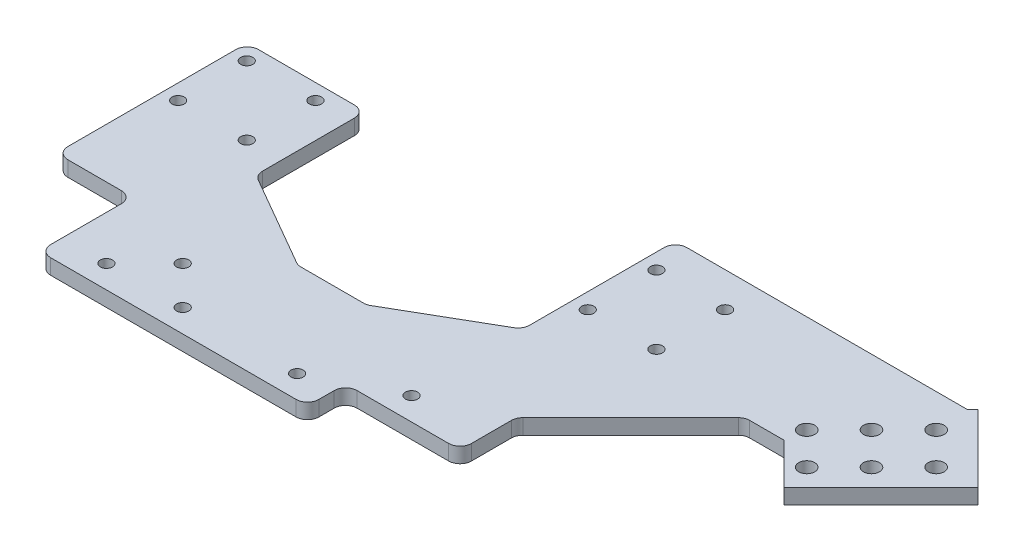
from build123d import *
from OCP.BRepFilletAPI import BRepFilletAPI_MakeChamfer

# Parameters (mm, degrees)
SKETCH_1_R          = 1.6
EXTRUDE_1_DEPTH     = 4
CUT_EXTRUDE_1_REACH = 136.759
SKETCH_2_W          = 30
SKETCH_2_H          = 10
CHAMFER_1_SIZE      = 15
CHAMFER_1_SIZE2     = 25.980762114
FILLET_1_R          = 3
EXTRUDE_2_DEPTH     = 4
SKETCH_4_R          = 2.1
CUT_EXTRUDE_2_DEPTH = 149.017584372


with BuildPart() as part:
    # Sketch 1 → Extrude 1 (new body)
    with BuildSketch(Plane(origin=(0, 0, 0), x_dir=(1, 0, 0), z_dir=(0, 1, 0))):
        Polygon((-56.1, -85.7), (44.22, -85.7), (44.22, -61), (74.22, -31), (103.92, -31), (103.92, 0), (25, 0), (25, -55), (-45, -55), (-45, -11.2), (-76.1, -11.2), (-76.1, -61.2), (-56.1, -61.2), align=None)
        with Locations(Location((5.5, -79.7, 0), (0, 0, 270))):
            Circle(SKETCH_1_R, mode=Mode.SUBTRACT)
        with Locations(Location((25.5, -79.7, 0), (0, 0, 270))):
            Circle(SKETCH_1_R, mode=Mode.SUBTRACT)
        with Locations(Location((25.5, -69.7, 0), (0, 0, 270))):
            Circle(SKETCH_1_R, mode=Mode.SUBTRACT)
        with Locations(Location((-72.1, -15.3, 0), (0, 0, 270))):
            Circle(SKETCH_1_R, mode=Mode.SUBTRACT)
        with Locations(Location((-54.1, -15.3, 0), (0, 0, 270))):
            Circle(SKETCH_1_R, mode=Mode.SUBTRACT)
        with Locations(Location((-54.1, -33.3, 0), (0, 0, 270))):
            Circle(SKETCH_1_R, mode=Mode.SUBTRACT)
        with Locations(Location((-72.1, -33.3, 0), (0, 0, 270))):
            Circle(SKETCH_1_R, mode=Mode.SUBTRACT)
        with Locations(Location((47.1, -27.1, 0), (0, 0, 270))):
            Circle(SKETCH_1_R, mode=Mode.SUBTRACT)
        with Locations(Location((47.1, -9.1, 0), (0, 0, 270))):
            Circle(SKETCH_1_R, mode=Mode.SUBTRACT)
        with Locations(Location((29.1, -9.1, 0), (0, 0, 270))):
            Circle(SKETCH_1_R, mode=Mode.SUBTRACT)
        with Locations(Location((29.1, -27.1, 0), (0, 0, 270))):
            Circle(SKETCH_1_R, mode=Mode.SUBTRACT)
        with Locations(Location((-24.5, -79.7, 0), (0, 0, 270))):
            Circle(SKETCH_1_R, mode=Mode.SUBTRACT)
        with Locations(Location((-44.5, -79.7, 0), (0, 0, 270))):
            Circle(SKETCH_1_R, mode=Mode.SUBTRACT)
        with Locations(Location((-34.5, -69.7, 0), (0, 0, 270))):
            Circle(SKETCH_1_R, mode=Mode.SUBTRACT)
    extrude(amount=EXTRUDE_1_DEPTH)

    # Sketch 2 → Cut-Extrude 1 (cut, up to next)
    with BuildSketch(Plane(origin=(0, 4, 0), x_dir=(1, 0, 0), z_dir=(0, 1, 0)), mode=Mode.PRIVATE) as cut_extrude_1_sk1:
        with Locations((29.22, -80.7)):
            Rectangle(SKETCH_2_W, SKETCH_2_H)
    cut_extrude_1_tool1 = extrude(cut_extrude_1_sk1.sketch, amount=-CUT_EXTRUDE_1_REACH, mode=Mode.PRIVATE) & part.part
    add(cut_extrude_1_tool1.solids().sort_by_distance((29.22, 4, 80.7))[0], mode=Mode.SUBTRACT)

    # Chamfer 1: one chamfer whose edges measure the first distance from different faces: ONE call of the kernel's chamfer builder (chamfer() names one face for all edges)
    chamfer_1_edges_1 = [part.edges().sort_by_distance(p)[0] for p in [
        (-45, 2, 55),
    ]]
    chamfer_1_side_1 = [part.faces().sort_by_distance(p)[0] for p in [
        (-45, 2, 33.1),
    ]]
    chamfer_1_edges_2 = [part.edges().sort_by_distance(p)[0] for p in [
        (25, 2, 55),
    ]]
    chamfer_1_side_2 = [part.faces().sort_by_distance(p)[0] for p in [
        (25, 2, 27.5),
    ]]
    chamfer_1 = BRepFilletAPI_MakeChamfer(part.part.solid().wrapped)
    for e in chamfer_1_edges_1:
        chamfer_1.Add(CHAMFER_1_SIZE, CHAMFER_1_SIZE2, e.wrapped, chamfer_1_side_1[0].wrapped)  # the first distance lies on this face
    for e in chamfer_1_edges_2:
        chamfer_1.Add(CHAMFER_1_SIZE, CHAMFER_1_SIZE2, e.wrapped, chamfer_1_side_2[0].wrapped)  # the first distance lies on this face
    add(Compound.cast(chamfer_1.Shape()), mode=Mode.REPLACE)

    # Fillet 1
    fillet_1_edges = [part.edges().sort_by_distance(p)[0] for p in [
        (14.22, 2, 85.7),
        (14.22, 2, 75.7),
        (-45, 2, 40),
        (-0.980762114, 2, 55),
        (-19.019237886, 2, 55),
        (25, 2, 40),
        (-56.1, 2, 85.7),
        (-56.1, 2, 61.2),
        (-76.1, 2, 61.2),
        (-76.1, 2, 11.2),
        (-45, 2, 11.2),
        (25, 2, 0),
        (74.22, 2, 31),
        (44.22, 2, 61),
        (44.22, 2, 75.7),
    ]]
    fillet(fillet_1_edges, radius=FILLET_1_R)

    # Sketch 3 → Extrude 2 (add, through all)
    with BuildSketch(Plane.XZ):
        Polygon((77.484541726, 24.08656198), (102.940385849, -1.369282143), (120.618055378, 16.308387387), (95.162211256, 41.764231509), align=None)
    extrude(amount=-EXTRUDE_2_DEPTH)

    # Sketch 4 → Cut-Extrude 2 (cut, through all)
    with BuildSketch(Plane.XZ):
        with Locations(Location((93.571220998, 34.162833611, 0), (0, 0, 270))):
            Circle(SKETCH_4_R)
        with Locations(Location((85.085939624, 25.677552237, 0), (0, 0, 270))):
            Circle(SKETCH_4_R)
        with Locations(Location((110.541783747, 17.192270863, 0), (0, 0, 270))):
            Circle(SKETCH_4_R)
        with Locations(Location((102.056502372, 25.677552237, 0), (0, 0, 270))):
            Circle(SKETCH_4_R)
        with Locations(Location((93.571220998, 17.192270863, 0), (0, 0, 270))):
            Circle(SKETCH_4_R)
        with Locations(Location((102.056502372, 8.706989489, 0), (0, 0, 270))):
            Circle(SKETCH_4_R)
    extrude(amount=-CUT_EXTRUDE_2_DEPTH, mode=Mode.SUBTRACT)


solid = part.part
